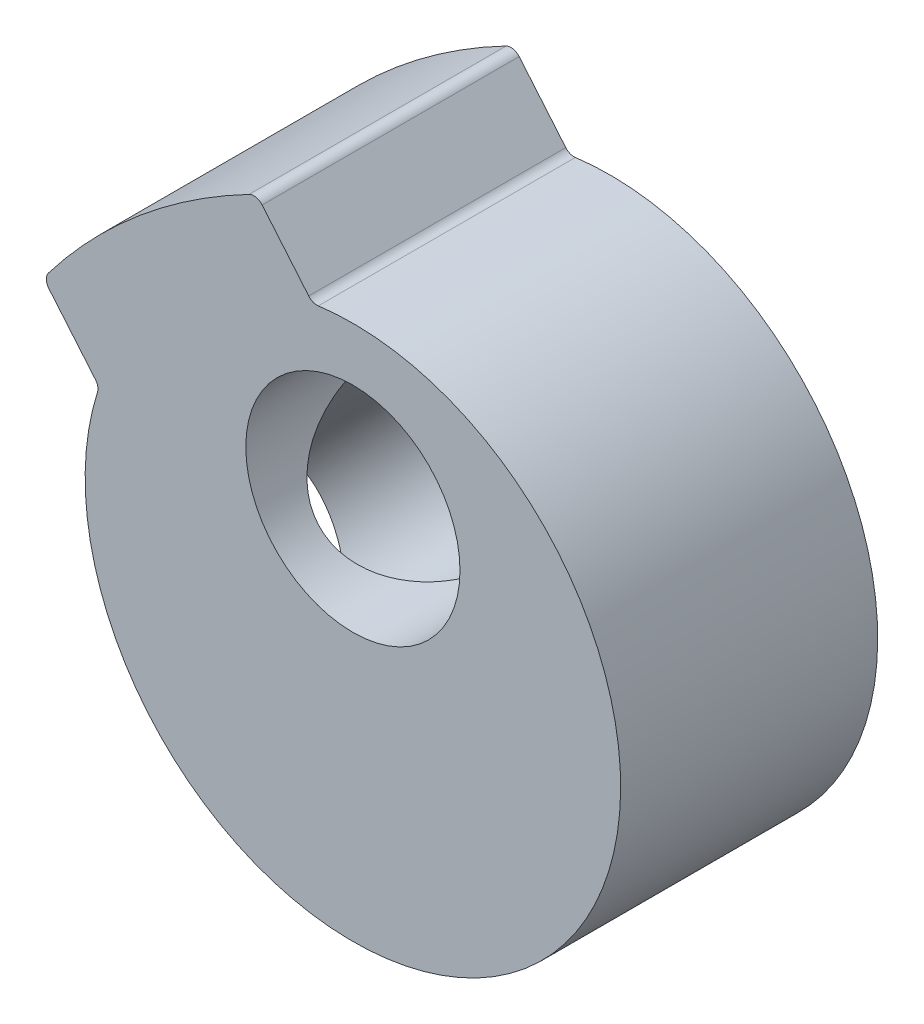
ISO-10303-21;
HEADER;
FILE_DESCRIPTION(('STEP AP214'),'2;1');
FILE_NAME('part.step','',(''),(''),'','','');
FILE_SCHEMA(('AUTOMOTIVE_DESIGN { 1 0 10303 214 1 1 1 1 }'));
ENDSEC;
DATA;
#1=APPLICATION_CONTEXT('core data for automotive mechanical design processes');
#2=APPLICATION_PROTOCOL_DEFINITION('international standard','automotive_design',2000,#1);
#3=PRODUCT_CONTEXT('',#1,'mechanical');
#4=PRODUCT('Part','Part','',(#3));
#5=PRODUCT_RELATED_PRODUCT_CATEGORY('part','',(#4));
#6=PRODUCT_DEFINITION_FORMATION('','',#4);
#7=PRODUCT_DEFINITION_CONTEXT('part definition',#1,'design');
#8=PRODUCT_DEFINITION('design','',#6,#7);
#9=PRODUCT_DEFINITION_SHAPE('','',#8);
#10=(LENGTH_UNIT() NAMED_UNIT(*) SI_UNIT(.MILLI.,.METRE.));
#11=(NAMED_UNIT(*) PLANE_ANGLE_UNIT() SI_UNIT($,.RADIAN.));
#12=(NAMED_UNIT(*) SI_UNIT($,.STERADIAN.) SOLID_ANGLE_UNIT());
#13=UNCERTAINTY_MEASURE_WITH_UNIT(LENGTH_MEASURE(1.E-05),#10,'distance_accuracy_value','');
#14=(GEOMETRIC_REPRESENTATION_CONTEXT(3) GLOBAL_UNCERTAINTY_ASSIGNED_CONTEXT((#13)) GLOBAL_UNIT_ASSIGNED_CONTEXT((#10,
#11,#12)) REPRESENTATION_CONTEXT('',''));
#15=CARTESIAN_POINT('',(0.,0.,0.));
#16=DIRECTION('',(0.,0.,1.));
#17=DIRECTION('',(1.,0.,0.));
#18=AXIS2_PLACEMENT_3D('',#15,#16,#17);
#19=CARTESIAN_POINT('',(-12.4036965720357,-1.10791683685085,6.));
#20=DIRECTION('',(0.,0.,1.));
#21=DIRECTION('',(1.,0.,0.));
#22=AXIS2_PLACEMENT_3D('',#19,#20,#21);
#23=PLANE('',#22);
#24=CARTESIAN_POINT('',(-12.4036965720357,-1.10791683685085,6.));
#25=DIRECTION('',(0.,0.,-1.));
#26=DIRECTION('',(1.,0.,0.));
#27=AXIS2_PLACEMENT_3D('',#24,#25,#26);
#28=CIRCLE('',#27,0.5);
#29=CARTESIAN_POINT('',(-12.0206743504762,-0.786523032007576,6.));
#30=VERTEX_POINT('',#29);
#31=CARTESIAN_POINT('',(-11.9266313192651,-1.25761234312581,6.));
#32=VERTEX_POINT('',#31);
#33=EDGE_CURVE('E148',#30,#32,#28,.T.);
#34=ORIENTED_EDGE('',*,*,#33,.T.);
#35=CARTESIAN_POINT('',(0.,-5.,6.));
#36=DIRECTION('',(0.,0.,1.));
#37=DIRECTION('',(1.,0.,0.));
#38=AXIS2_PLACEMENT_3D('',#35,#36,#37);
#39=CIRCLE('',#38,12.5);
#40=CARTESIAN_POINT('',(-1.61449458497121,7.39529778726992,6.));
#41=VERTEX_POINT('',#40);
#42=EDGE_CURVE('E125',#32,#41,#39,.T.);
#43=ORIENTED_EDGE('',*,*,#42,.T.);
#44=CARTESIAN_POINT('',(-1.67907436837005,7.89110969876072,6.));
#45=DIRECTION('',(0.,0.,-1.));
#46=DIRECTION('',(1.,0.,0.));
#47=AXIS2_PLACEMENT_3D('',#44,#45,#46);
#48=CIRCLE('',#47,0.499999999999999);
#49=CARTESIAN_POINT('',(-2.06209658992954,7.56971589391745,6.));
#50=VERTEX_POINT('',#49);
#51=EDGE_CURVE('E151',#41,#50,#48,.T.);
#52=ORIENTED_EDGE('',*,*,#51,.T.);
#53=DIRECTION('',(-0.642787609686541,0.766044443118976,0.));
#54=VECTOR('',#53,1.);
#55=CARTESIAN_POINT('',(-4.23666163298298,10.1612615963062,6.));
#56=LINE('',#55,#54);
#57=CARTESIAN_POINT('',(-4.23666163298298,10.1612615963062,6.));
#58=VERTEX_POINT('',#57);
#59=EDGE_CURVE('E153',#50,#58,#56,.T.);
#60=ORIENTED_EDGE('',*,*,#59,.T.);
#61=CARTESIAN_POINT('',(-4.61968385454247,9.83986779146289,6.));
#62=DIRECTION('',(0.,0.,1.));
#63=DIRECTION('',(-1.,0.,0.));
#64=AXIS2_PLACEMENT_3D('',#61,#62,#63);
#65=CIRCLE('',#64,0.499999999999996);
#66=CARTESIAN_POINT('',(-4.84976619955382,10.2837845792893,6.));
#67=VERTEX_POINT('',#66);
#68=EDGE_CURVE('E155',#58,#67,#65,.T.);
#69=ORIENTED_EDGE('',*,*,#68,.T.);
#70=CARTESIAN_POINT('',(8.03484512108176,-14.5755555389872,6.));
#71=DIRECTION('',(0.,0.,1.));
#72=DIRECTION('',(1.,0.,0.));
#73=AXIS2_PLACEMENT_3D('',#70,#71,#72);
#74=CIRCLE('',#73,28.);
#75=CARTESIAN_POINT('',(-14.2094364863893,2.43008869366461,6.));
#76=VERTEX_POINT('',#75);
#77=EDGE_CURVE('E157',#67,#76,#74,.T.);
#78=ORIENTED_EDGE('',*,*,#77,.T.);
#79=CARTESIAN_POINT('',(-13.8122171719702,2.1264164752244,6.));
#80=DIRECTION('',(0.,0.,1.));
#81=DIRECTION('',(1.,0.,0.));
#82=AXIS2_PLACEMENT_3D('',#79,#80,#81);
#83=CIRCLE('',#82,0.499999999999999);
#84=CARTESIAN_POINT('',(-14.1952393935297,1.80502267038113,6.));
#85=VERTEX_POINT('',#84);
#86=EDGE_CURVE('E66',#76,#85,#83,.T.);
#87=ORIENTED_EDGE('',*,*,#86,.T.);
#88=DIRECTION('',(0.642787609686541,-0.766044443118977,0.));
#89=VECTOR('',#88,1.);
#90=CARTESIAN_POINT('',(-14.1952393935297,1.80502267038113,6.));
#91=LINE('',#90,#89);
#92=EDGE_CURVE('E61',#85,#30,#91,.T.);
#93=ORIENTED_EDGE('',*,*,#92,.T.);
#94=EDGE_LOOP('',(#34,#43,#52,#60,#69,#78,#87,#93));
#95=FACE_BOUND('',#94,.T.);
#96=CARTESIAN_POINT('',(0.,0.,6.));
#97=DIRECTION('',(0.,0.,1.));
#98=DIRECTION('',(1.,0.,0.));
#99=AXIS2_PLACEMENT_3D('',#96,#97,#98);
#100=CIRCLE('',#99,5.);
#101=CARTESIAN_POINT('',(5.,0.,6.));
#102=VERTEX_POINT('',#101);
#103=EDGE_CURVE('E130',#102,#102,#100,.T.);
#104=ORIENTED_EDGE('',*,*,#103,.F.);
#105=EDGE_LOOP('',(#104));
#106=FACE_BOUND('',#105,.T.);
#107=ADVANCED_FACE('F40',(#95,#106),#23,.T.);
#108=CARTESIAN_POINT('',(-12.4036965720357,-1.10791683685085,-6.));
#109=DIRECTION('',(0.,0.,1.));
#110=DIRECTION('',(1.,0.,0.));
#111=AXIS2_PLACEMENT_3D('',#108,#109,#110);
#112=PLANE('',#111);
#113=CARTESIAN_POINT('',(-12.4036965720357,-1.10791683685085,-6.));
#114=DIRECTION('',(0.,0.,-1.));
#115=DIRECTION('',(1.,0.,0.));
#116=AXIS2_PLACEMENT_3D('',#113,#114,#115);
#117=CIRCLE('',#116,0.5);
#118=CARTESIAN_POINT('',(-12.0206743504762,-0.786523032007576,-6.));
#119=VERTEX_POINT('',#118);
#120=CARTESIAN_POINT('',(-11.9266313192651,-1.25761234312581,-6.));
#121=VERTEX_POINT('',#120);
#122=EDGE_CURVE('E116',#119,#121,#117,.T.);
#123=ORIENTED_EDGE('',*,*,#122,.F.);
#124=DIRECTION('',(0.642787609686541,-0.766044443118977,0.));
#125=VECTOR('',#124,1.);
#126=CARTESIAN_POINT('',(-14.1952393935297,1.80502267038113,-6.));
#127=LINE('',#126,#125);
#128=CARTESIAN_POINT('',(-14.1952393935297,1.80502267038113,-6.));
#129=VERTEX_POINT('',#128);
#130=EDGE_CURVE('E146',#129,#119,#127,.T.);
#131=ORIENTED_EDGE('',*,*,#130,.F.);
#132=CARTESIAN_POINT('',(-13.8122171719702,2.1264164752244,-6.));
#133=DIRECTION('',(0.,0.,1.));
#134=DIRECTION('',(1.,0.,0.));
#135=AXIS2_PLACEMENT_3D('',#132,#133,#134);
#136=CIRCLE('',#135,0.499999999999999);
#137=CARTESIAN_POINT('',(-14.2094364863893,2.43008869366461,-6.));
#138=VERTEX_POINT('',#137);
#139=EDGE_CURVE('E144',#138,#129,#136,.T.);
#140=ORIENTED_EDGE('',*,*,#139,.F.);
#141=CARTESIAN_POINT('',(8.03484512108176,-14.5755555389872,-6.));
#142=DIRECTION('',(0.,0.,1.));
#143=DIRECTION('',(1.,0.,0.));
#144=AXIS2_PLACEMENT_3D('',#141,#142,#143);
#145=CIRCLE('',#144,28.);
#146=CARTESIAN_POINT('',(-4.84976619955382,10.2837845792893,-6.));
#147=VERTEX_POINT('',#146);
#148=EDGE_CURVE('E142',#147,#138,#145,.T.);
#149=ORIENTED_EDGE('',*,*,#148,.F.);
#150=CARTESIAN_POINT('',(-4.61968385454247,9.83986779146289,-6.));
#151=DIRECTION('',(0.,0.,1.));
#152=DIRECTION('',(-1.,0.,0.));
#153=AXIS2_PLACEMENT_3D('',#150,#151,#152);
#154=CIRCLE('',#153,0.499999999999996);
#155=CARTESIAN_POINT('',(-4.23666163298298,10.1612615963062,-6.));
#156=VERTEX_POINT('',#155);
#157=EDGE_CURVE('E140',#156,#147,#154,.T.);
#158=ORIENTED_EDGE('',*,*,#157,.F.);
#159=DIRECTION('',(-0.642787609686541,0.766044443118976,0.));
#160=VECTOR('',#159,1.);
#161=CARTESIAN_POINT('',(-4.23666163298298,10.1612615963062,-6.));
#162=LINE('',#161,#160);
#163=CARTESIAN_POINT('',(-2.06209658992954,7.56971589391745,-6.));
#164=VERTEX_POINT('',#163);
#165=EDGE_CURVE('E138',#164,#156,#162,.T.);
#166=ORIENTED_EDGE('',*,*,#165,.F.);
#167=CARTESIAN_POINT('',(-1.67907436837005,7.89110969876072,-6.));
#168=DIRECTION('',(0.,0.,-1.));
#169=DIRECTION('',(1.,0.,0.));
#170=AXIS2_PLACEMENT_3D('',#167,#168,#169);
#171=CIRCLE('',#170,0.499999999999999);
#172=CARTESIAN_POINT('',(-1.61449458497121,7.39529778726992,-6.));
#173=VERTEX_POINT('',#172);
#174=EDGE_CURVE('E118',#173,#164,#171,.T.);
#175=ORIENTED_EDGE('',*,*,#174,.F.);
#176=CARTESIAN_POINT('',(0.,-5.,-6.));
#177=DIRECTION('',(0.,0.,1.));
#178=DIRECTION('',(1.,0.,0.));
#179=AXIS2_PLACEMENT_3D('',#176,#177,#178);
#180=CIRCLE('',#179,12.5);
#181=EDGE_CURVE('E111',#121,#173,#180,.T.);
#182=ORIENTED_EDGE('',*,*,#181,.F.);
#183=EDGE_LOOP('',(#123,#131,#140,#149,#158,#166,#175,#182));
#184=FACE_BOUND('',#183,.T.);
#185=CARTESIAN_POINT('',(0.,0.,-6.));
#186=DIRECTION('',(0.,0.,1.));
#187=DIRECTION('',(1.,0.,0.));
#188=AXIS2_PLACEMENT_3D('',#185,#186,#187);
#189=CIRCLE('',#188,5.);
#190=CARTESIAN_POINT('',(5.,0.,-6.));
#191=VERTEX_POINT('',#190);
#192=EDGE_CURVE('E133',#191,#191,#189,.T.);
#193=ORIENTED_EDGE('',*,*,#192,.T.);
#194=EDGE_LOOP('',(#193));
#195=FACE_BOUND('',#194,.T.);
#196=ADVANCED_FACE('F112',(#184,#195),#112,.F.);
#197=CARTESIAN_POINT('',(-12.4036965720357,-1.10791683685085,6.));
#198=DIRECTION('',(0.,0.,-1.));
#199=DIRECTION('',(-1.,0.,0.));
#200=AXIS2_PLACEMENT_3D('',#197,#198,#199);
#201=CYLINDRICAL_SURFACE('',#200,0.5);
#202=ORIENTED_EDGE('',*,*,#122,.T.);
#203=DIRECTION('',(0.,0.,-1.));
#204=VECTOR('',#203,1.);
#205=CARTESIAN_POINT('',(-11.9266313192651,-1.25761234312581,6.));
#206=LINE('',#205,#204);
#207=EDGE_CURVE('E11',#32,#121,#206,.T.);
#208=ORIENTED_EDGE('',*,*,#207,.F.);
#209=ORIENTED_EDGE('',*,*,#33,.F.);
#210=DIRECTION('',(0.,0.,-1.));
#211=VECTOR('',#210,1.);
#212=CARTESIAN_POINT('',(-12.0206743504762,-0.786523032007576,6.));
#213=LINE('',#212,#211);
#214=EDGE_CURVE('E129',#30,#119,#213,.T.);
#215=ORIENTED_EDGE('',*,*,#214,.T.);
#216=EDGE_LOOP('',(#202,#208,#209,#215));
#217=FACE_BOUND('',#216,.T.);
#218=ADVANCED_FACE('F42',(#217),#201,.F.);
#219=CARTESIAN_POINT('',(0.,-5.,6.));
#220=DIRECTION('',(0.,0.,-1.));
#221=DIRECTION('',(-1.,0.,0.));
#222=AXIS2_PLACEMENT_3D('',#219,#220,#221);
#223=CYLINDRICAL_SURFACE('',#222,12.5);
#224=CARTESIAN_POINT('',(-12.380580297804,-6.72372604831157,0.));
#225=CARTESIAN_POINT('',(-12.3805802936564,-6.72372607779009,0.0985646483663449));
#226=CARTESIAN_POINT('',(-12.3799518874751,-6.7282578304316,0.197129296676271));
#227=CARTESIAN_POINT('',(-12.3774226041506,-6.74627930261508,0.393455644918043));
#228=CARTESIAN_POINT('',(-12.3755212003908,-6.75977272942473,0.49121699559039));
#229=CARTESIAN_POINT('',(-12.3703998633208,-6.79541934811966,0.685130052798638));
#230=CARTESIAN_POINT('',(-12.3671796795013,-6.81757418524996,0.781281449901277));
#231=CARTESIAN_POINT('',(-12.3593505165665,-6.87006794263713,0.97128099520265));
#232=CARTESIAN_POINT('',(-12.354740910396,-6.90041055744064,1.06512808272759));
#233=CARTESIAN_POINT('',(-12.3387604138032,-7.0024320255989,1.34107903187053));
#234=CARTESIAN_POINT('',(-12.3252035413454,-7.0853757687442,1.51899942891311));
#235=CARTESIAN_POINT('',(-12.2913876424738,-7.27621092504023,1.85997105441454));
#236=CARTESIAN_POINT('',(-12.2711264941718,-7.38411023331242,2.02301755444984));
#237=CARTESIAN_POINT('',(-12.2204366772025,-7.63221127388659,2.34851029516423));
#238=CARTESIAN_POINT('',(-12.1891745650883,-7.77459736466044,2.5091584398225));
#239=CARTESIAN_POINT('',(-12.1160422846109,-8.07830225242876,2.80865753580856));
#240=CARTESIAN_POINT('',(-12.0741660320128,-8.23963187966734,2.94749591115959));
#241=CARTESIAN_POINT('',(-11.9703271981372,-8.60604340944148,3.22419113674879));
#242=CARTESIAN_POINT('',(-11.906132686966,-8.81384291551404,3.35763083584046));
#243=CARTESIAN_POINT('',(-11.7601561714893,-9.2426309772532,3.58966993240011));
#244=CARTESIAN_POINT('',(-11.6783658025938,-9.46362576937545,3.68825270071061));
#245=CARTESIAN_POINT('',(-11.5405948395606,-9.80422694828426,3.80889072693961));
#246=CARTESIAN_POINT('',(-11.4910463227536,-9.92163243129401,3.84497386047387));
#247=CARTESIAN_POINT('',(-11.3872663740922,-10.1571972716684,3.90624846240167));
#248=CARTESIAN_POINT('',(-11.3330369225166,-10.2753562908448,3.93144450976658));
#249=CARTESIAN_POINT('',(-11.2201456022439,-10.511392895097,3.97044492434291));
#250=CARTESIAN_POINT('',(-11.1614851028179,-10.629270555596,3.98425279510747));
#251=CARTESIAN_POINT('',(-11.0401135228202,-10.8637281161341,4.00004072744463));
#252=CARTESIAN_POINT('',(-10.9774028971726,-10.9803081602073,4.00202211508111));
#253=CARTESIAN_POINT('',(-10.8538115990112,-11.201571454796,3.99414112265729));
#254=CARTESIAN_POINT('',(-10.7932061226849,-11.3064432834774,3.98524147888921));
#255=CARTESIAN_POINT('',(-10.6696237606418,-11.5133435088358,3.95700845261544));
#256=CARTESIAN_POINT('',(-10.6066471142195,-11.6153721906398,3.93767612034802));
#257=CARTESIAN_POINT('',(-10.4790200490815,-11.8157349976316,3.88852701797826));
#258=CARTESIAN_POINT('',(-10.4143703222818,-11.9140706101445,3.85871451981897));
#259=CARTESIAN_POINT('',(-10.284147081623,-12.1063208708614,3.78867564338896));
#260=CARTESIAN_POINT('',(-10.2185736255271,-12.2002357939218,3.74844991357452));
#261=CARTESIAN_POINT('',(-10.0928943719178,-12.3752352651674,3.66162705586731));
#262=CARTESIAN_POINT('',(-10.0327940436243,-12.456733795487,3.61585383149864));
#263=CARTESIAN_POINT('',(-9.9132006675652,-12.6150044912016,3.51600261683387));
#264=CARTESIAN_POINT('',(-9.85370782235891,-12.6917751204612,3.46192194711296));
#265=CARTESIAN_POINT('',(-9.73608646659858,-12.8401262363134,3.34584433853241));
#266=CARTESIAN_POINT('',(-9.67795734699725,-12.9117090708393,3.28385101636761));
#267=CARTESIAN_POINT('',(-9.56372224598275,-13.0494239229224,3.15233364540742));
#268=CARTESIAN_POINT('',(-9.50761702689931,-13.1155538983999,3.08280679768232));
#269=CARTESIAN_POINT('',(-9.39915367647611,-13.2409134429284,2.93807473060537));
#270=CARTESIAN_POINT('',(-9.34674554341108,-13.3002477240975,2.86299777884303));
#271=CARTESIAN_POINT('',(-9.24518975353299,-13.4132181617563,2.7065956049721));
#272=CARTESIAN_POINT('',(-9.19604327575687,-13.4668522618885,2.62526814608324));
#273=CARTESIAN_POINT('',(-9.05444643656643,-13.6189436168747,2.37277487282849));
#274=CARTESIAN_POINT('',(-8.96773293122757,-13.7087100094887,2.19295820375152));
#275=CARTESIAN_POINT('',(-8.81264185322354,-13.8656542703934,1.81190191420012));
#276=CARTESIAN_POINT('',(-8.74464331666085,-13.9323713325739,1.61032061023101));
#277=CARTESIAN_POINT('',(-8.63263585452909,-14.0406687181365,1.19412687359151));
#278=CARTESIAN_POINT('',(-8.58862819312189,-14.0822477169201,0.979513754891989));
#279=CARTESIAN_POINT('',(-8.52658194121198,-14.1405287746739,0.540680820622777));
#280=CARTESIAN_POINT('',(-8.50885043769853,-14.1569367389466,0.31637845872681));
#281=CARTESIAN_POINT('',(-8.50129703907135,-14.163949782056,-0.133099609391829));
#282=CARTESIAN_POINT('',(-8.51147546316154,-14.1545545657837,-0.35827532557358));
#283=CARTESIAN_POINT('',(-8.55918413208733,-14.1099624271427,-0.803093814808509));
#284=CARTESIAN_POINT('',(-8.59671301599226,-14.074766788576,-1.02273686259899));
#285=CARTESIAN_POINT('',(-8.69709381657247,-13.978605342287,-1.45029312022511));
#286=CARTESIAN_POINT('',(-8.75994687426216,-13.917638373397,-1.65820580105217));
#287=CARTESIAN_POINT('',(-8.90768905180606,-13.7700590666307,-2.05651944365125));
#288=CARTESIAN_POINT('',(-8.99259140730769,-13.6834313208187,-2.2469097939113));
#289=CARTESIAN_POINT('',(-9.17998877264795,-13.4850668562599,-2.60455696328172));
#290=CARTESIAN_POINT('',(-9.28248259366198,-13.3733318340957,-2.77181534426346));
#291=CARTESIAN_POINT('',(-9.49885778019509,-13.127009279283,-3.07698946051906));
#292=CARTESIAN_POINT('',(-9.61263320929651,-12.9926273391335,-3.21514602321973));
#293=CARTESIAN_POINT('',(-9.84662614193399,-12.7025064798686,-3.45995208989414));
#294=CARTESIAN_POINT('',(-9.96684228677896,-12.54677205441,-3.56660820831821));
#295=CARTESIAN_POINT('',(-10.2055536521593,-12.220572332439,-3.74388040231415));
#296=CARTESIAN_POINT('',(-10.3240347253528,-12.0504671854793,-3.81517951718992));
#297=CARTESIAN_POINT('',(-10.5567267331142,-11.6970344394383,-3.92374162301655));
#298=CARTESIAN_POINT('',(-10.670937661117,-11.5137068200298,-3.96100456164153));
#299=CARTESIAN_POINT('',(-10.8917896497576,-11.1373323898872,-4.00189634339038));
#300=CARTESIAN_POINT('',(-10.998375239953,-10.9442289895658,-4.00529957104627));
#301=CARTESIAN_POINT('',(-11.2002993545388,-10.5544164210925,-3.97937196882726));
#302=CARTESIAN_POINT('',(-11.2956348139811,-10.3577062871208,-3.95003224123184));
#303=CARTESIAN_POINT('',(-11.4792703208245,-9.95267157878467,-3.85786342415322));
#304=CARTESIAN_POINT('',(-11.5667059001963,-9.74442631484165,-3.79297481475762));
#305=CARTESIAN_POINT('',(-11.7264479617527,-9.33461456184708,-3.63135181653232));
#306=CARTESIAN_POINT('',(-11.7987479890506,-9.1330509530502,-3.53460388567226));
#307=CARTESIAN_POINT('',(-11.9348499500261,-8.72294727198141,-3.30113541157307));
#308=CARTESIAN_POINT('',(-11.9971779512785,-8.51558345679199,-3.16147699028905));
#309=CARTESIAN_POINT('',(-12.1056236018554,-8.12180740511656,-2.8496644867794));
#310=CARTESIAN_POINT('',(-12.1517239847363,-7.9354176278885,-2.67747608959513));
#311=CARTESIAN_POINT('',(-12.2307513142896,-7.58680315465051,-2.29725839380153));
#312=CARTESIAN_POINT('',(-12.2632553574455,-7.42544064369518,-2.08833109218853));
#313=CARTESIAN_POINT('',(-12.3023244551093,-7.2153853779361,-1.7542509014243));
#314=CARTESIAN_POINT('',(-12.3137301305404,-7.15071958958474,-1.63949712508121));
#315=CARTESIAN_POINT('',(-12.333633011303,-7.03347569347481,-1.40370171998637));
#316=CARTESIAN_POINT('',(-12.3421314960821,-6.98089227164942,-1.28266288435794));
#317=CARTESIAN_POINT('',(-12.3546693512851,-6.90088089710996,-1.06651475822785));
#318=CARTESIAN_POINT('',(-12.3592926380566,-6.87045234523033,-0.972539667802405));
#319=CARTESIAN_POINT('',(-12.3671451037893,-6.81780965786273,-0.782264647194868));
#320=CARTESIAN_POINT('',(-12.3703746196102,-6.79559353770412,-0.685965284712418));
#321=CARTESIAN_POINT('',(-12.3755086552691,-6.7598615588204,-0.49181168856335));
#322=CARTESIAN_POINT('',(-12.3774143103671,-6.74633824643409,-0.393958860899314));
#323=CARTESIAN_POINT('',(-12.3799501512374,-6.72827035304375,-0.197404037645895));
#324=CARTESIAN_POINT('',(-12.3805803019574,-6.72372601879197,-0.0987020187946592));
#325=CARTESIAN_POINT('',(-12.380580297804,-6.72372604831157,0.));
#326=B_SPLINE_CURVE_WITH_KNOTS('',3,(#224,#225,#226,#227,#228,#229,#230,#231,#232,#233,#234,
#235,#236,#237,#238,#239,#240,#241,#242,#243,#244,#245,#246,#247,#248,#249,#250,#251,#252,#253,
#254,#255,#256,#257,#258,#259,#260,#261,#262,#263,#264,#265,#266,#267,#268,#269,#270,#271,#272,
#273,#274,#275,#276,#277,#278,#279,#280,#281,#282,#283,#284,#285,#286,#287,#288,#289,#290,#291,
#292,#293,#294,#295,#296,#297,#298,#299,#300,#301,#302,#303,#304,#305,#306,#307,#308,#309,#310,
#311,#312,#313,#314,#315,#316,#317,#318,#319,#320,#321,#322,#323,#324,#325),.UNSPECIFIED.,.T.,
.F.,(4,2,2,2,2,2,2,2,2,2,2,2,2,2,2,2,2,2,2,2,2,2,2,2,2,2,2,2,2,2,2,2,2,2,2,2,2,2,2,2,2,2,2,2,2,
2,2,2,2,2,4),(0.,0.295588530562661,0.591299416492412,0.887066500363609,1.18296726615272,
1.77052492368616,2.35826872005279,3.00666192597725,3.65542764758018,4.41764173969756,
5.18021897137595,5.57710271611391,5.97381937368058,6.37041393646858,6.7669640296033,
7.13082934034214,7.49465802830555,7.85833858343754,8.22199649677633,8.55497231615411,
8.88805575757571,9.22098749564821,9.55404335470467,9.88096101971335,10.2079962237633,
10.861436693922,11.5272728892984,12.1931441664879,12.8667376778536,13.5403388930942,
14.2139065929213,14.8875046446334,15.5615079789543,16.2354657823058,16.9036058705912,
17.571605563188,18.2261421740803,18.8806797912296,19.5395758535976,20.1986510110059,
20.9007142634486,21.6030763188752,22.3726074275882,23.1429548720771,23.9357446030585,
24.3317945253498,24.727669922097,25.023988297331,25.3202350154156,25.6162273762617,
25.9122278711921),.UNSPECIFIED.);
#327=CARTESIAN_POINT('',(-12.380580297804,-6.72372604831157,0.));
#328=VERTEX_POINT('',#327);
#329=EDGE_CURVE('E223',#328,#328,#326,.T.);
#330=ORIENTED_EDGE('',*,*,#329,.T.);
#331=EDGE_LOOP('',(#330));
#332=FACE_BOUND('',#331,.T.);
#333=ORIENTED_EDGE('',*,*,#181,.T.);
#334=DIRECTION('',(0.,0.,-1.));
#335=VECTOR('',#334,1.);
#336=CARTESIAN_POINT('',(-1.61449458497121,7.39529778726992,6.));
#337=LINE('',#336,#335);
#338=EDGE_CURVE('E54',#41,#173,#337,.T.);
#339=ORIENTED_EDGE('',*,*,#338,.F.);
#340=ORIENTED_EDGE('',*,*,#42,.F.);
#341=ORIENTED_EDGE('',*,*,#207,.T.);
#342=EDGE_LOOP('',(#333,#339,#340,#341));
#343=FACE_BOUND('',#342,.T.);
#344=ADVANCED_FACE('F124',(#332,#343),#223,.T.);
#345=CARTESIAN_POINT('',(-1.67907436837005,7.89110969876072,6.));
#346=DIRECTION('',(0.,0.,-1.));
#347=DIRECTION('',(-1.,0.,0.));
#348=AXIS2_PLACEMENT_3D('',#345,#346,#347);
#349=CYLINDRICAL_SURFACE('',#348,0.499999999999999);
#350=ORIENTED_EDGE('',*,*,#174,.T.);
#351=DIRECTION('',(0.,0.,-1.));
#352=VECTOR('',#351,1.);
#353=CARTESIAN_POINT('',(-2.06209658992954,7.56971589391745,6.));
#354=LINE('',#353,#352);
#355=EDGE_CURVE('E174',#50,#164,#354,.T.);
#356=ORIENTED_EDGE('',*,*,#355,.F.);
#357=ORIENTED_EDGE('',*,*,#51,.F.);
#358=ORIENTED_EDGE('',*,*,#338,.T.);
#359=EDGE_LOOP('',(#350,#356,#357,#358));
#360=FACE_BOUND('',#359,.T.);
#361=ADVANCED_FACE('F179',(#360),#349,.F.);
#362=CARTESIAN_POINT('',(-4.23666163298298,10.1612615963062,6.));
#363=DIRECTION('',(-0.766044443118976,-0.642787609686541,0.));
#364=DIRECTION('',(0.642787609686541,-0.766044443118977,0.));
#365=AXIS2_PLACEMENT_3D('',#362,#363,#364);
#366=PLANE('',#365);
#367=ORIENTED_EDGE('',*,*,#165,.T.);
#368=DIRECTION('',(0.,0.,-1.));
#369=VECTOR('',#368,1.);
#370=CARTESIAN_POINT('',(-4.23666163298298,10.1612615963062,6.));
#371=LINE('',#370,#369);
#372=EDGE_CURVE('E171',#58,#156,#371,.T.);
#373=ORIENTED_EDGE('',*,*,#372,.F.);
#374=ORIENTED_EDGE('',*,*,#59,.F.);
#375=ORIENTED_EDGE('',*,*,#355,.T.);
#376=EDGE_LOOP('',(#367,#373,#374,#375));
#377=FACE_BOUND('',#376,.T.);
#378=ADVANCED_FACE('F187',(#377),#366,.F.);
#379=CARTESIAN_POINT('',(-4.61968385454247,9.83986779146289,6.));
#380=DIRECTION('',(0.,0.,-1.));
#381=DIRECTION('',(-1.,0.,0.));
#382=AXIS2_PLACEMENT_3D('',#379,#380,#381);
#383=CYLINDRICAL_SURFACE('',#382,0.499999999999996);
#384=ORIENTED_EDGE('',*,*,#157,.T.);
#385=DIRECTION('',(0.,0.,-1.));
#386=VECTOR('',#385,1.);
#387=CARTESIAN_POINT('',(-4.84976619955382,10.2837845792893,6.));
#388=LINE('',#387,#386);
#389=EDGE_CURVE('E168',#67,#147,#388,.T.);
#390=ORIENTED_EDGE('',*,*,#389,.F.);
#391=ORIENTED_EDGE('',*,*,#68,.F.);
#392=ORIENTED_EDGE('',*,*,#372,.T.);
#393=EDGE_LOOP('',(#384,#390,#391,#392));
#394=FACE_BOUND('',#393,.T.);
#395=ADVANCED_FACE('F190',(#394),#383,.T.);
#396=CARTESIAN_POINT('',(8.03484512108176,-14.5755555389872,6.));
#397=DIRECTION('',(0.,0.,-1.));
#398=DIRECTION('',(-1.,0.,0.));
#399=AXIS2_PLACEMENT_3D('',#396,#397,#398);
#400=CYLINDRICAL_SURFACE('',#399,28.);
#401=ORIENTED_EDGE('',*,*,#148,.T.);
#402=DIRECTION('',(0.,0.,-1.));
#403=VECTOR('',#402,1.);
#404=CARTESIAN_POINT('',(-14.2094364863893,2.43008869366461,6.));
#405=LINE('',#404,#403);
#406=EDGE_CURVE('E165',#76,#138,#405,.T.);
#407=ORIENTED_EDGE('',*,*,#406,.F.);
#408=ORIENTED_EDGE('',*,*,#77,.F.);
#409=ORIENTED_EDGE('',*,*,#389,.T.);
#410=EDGE_LOOP('',(#401,#407,#408,#409));
#411=FACE_BOUND('',#410,.T.);
#412=ADVANCED_FACE('F195',(#411),#400,.T.);
#413=CARTESIAN_POINT('',(-13.8122171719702,2.1264164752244,6.));
#414=DIRECTION('',(0.,0.,-1.));
#415=DIRECTION('',(-1.,0.,0.));
#416=AXIS2_PLACEMENT_3D('',#413,#414,#415);
#417=CYLINDRICAL_SURFACE('',#416,0.499999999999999);
#418=ORIENTED_EDGE('',*,*,#139,.T.);
#419=DIRECTION('',(0.,0.,-1.));
#420=VECTOR('',#419,1.);
#421=CARTESIAN_POINT('',(-14.1952393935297,1.80502267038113,6.));
#422=LINE('',#421,#420);
#423=EDGE_CURVE('E162',#85,#129,#422,.T.);
#424=ORIENTED_EDGE('',*,*,#423,.F.);
#425=ORIENTED_EDGE('',*,*,#86,.F.);
#426=ORIENTED_EDGE('',*,*,#406,.T.);
#427=EDGE_LOOP('',(#418,#424,#425,#426));
#428=FACE_BOUND('',#427,.T.);
#429=ADVANCED_FACE('F198',(#428),#417,.T.);
#430=CARTESIAN_POINT('',(-14.1952393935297,1.80502267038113,6.));
#431=DIRECTION('',(0.766044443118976,0.642787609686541,0.));
#432=DIRECTION('',(-0.642787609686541,0.766044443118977,0.));
#433=AXIS2_PLACEMENT_3D('',#430,#431,#432);
#434=PLANE('',#433);
#435=ORIENTED_EDGE('',*,*,#130,.T.);
#436=ORIENTED_EDGE('',*,*,#214,.F.);
#437=ORIENTED_EDGE('',*,*,#92,.F.);
#438=ORIENTED_EDGE('',*,*,#423,.T.);
#439=EDGE_LOOP('',(#435,#436,#437,#438));
#440=FACE_BOUND('',#439,.T.);
#441=ADVANCED_FACE('F200',(#440),#434,.F.);
#442=CARTESIAN_POINT('',(0.,0.,6.));
#443=DIRECTION('',(0.,0.,-1.));
#444=DIRECTION('',(-1.,0.,0.));
#445=AXIS2_PLACEMENT_3D('',#442,#443,#444);
#446=CYLINDRICAL_SURFACE('',#445,5.);
#447=CARTESIAN_POINT('',(-5.,0.,1.87082869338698));
#448=CARTESIAN_POINT('',(-4.99999920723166,-0.0812449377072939,1.97939952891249));
#449=CARTESIAN_POINT('',(-4.99801059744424,-0.167032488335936,2.08461508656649));
#450=CARTESIAN_POINT('',(-4.98882133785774,-0.345985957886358,2.28841921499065));
#451=CARTESIAN_POINT('',(-4.98161657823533,-0.439157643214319,2.38700249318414));
#452=CARTESIAN_POINT('',(-4.96086844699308,-0.631819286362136,2.57769005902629));
#453=CARTESIAN_POINT('',(-4.94730650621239,-0.731327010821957,2.6697744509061));
#454=CARTESIAN_POINT('',(-4.91284702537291,-0.935218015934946,2.84678152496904));
#455=CARTESIAN_POINT('',(-4.89195237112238,-1.03959936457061,2.93170700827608));
#456=CARTESIAN_POINT('',(-4.82497264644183,-1.32403397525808,3.14870992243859));
#457=CARTESIAN_POINT('',(-4.77140108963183,-1.50767404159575,3.27399009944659));
#458=CARTESIAN_POINT('',(-4.63722518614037,-1.88020908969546,3.49914261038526));
#459=CARTESIAN_POINT('',(-4.55668603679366,-2.06909039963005,3.59907521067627));
#460=CARTESIAN_POINT('',(-4.3826818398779,-2.41298959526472,3.75400059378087));
#461=CARTESIAN_POINT('',(-4.29388670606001,-2.56819481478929,3.81378295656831));
#462=CARTESIAN_POINT('',(-4.09614603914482,-2.87306888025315,3.90971240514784));
#463=CARTESIAN_POINT('',(-3.98720922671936,-3.02274008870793,3.94586968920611));
#464=CARTESIAN_POINT('',(-3.75051997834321,-3.31189068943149,3.99237052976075));
#465=CARTESIAN_POINT('',(-3.62269557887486,-3.45132790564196,4.002612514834));
#466=CARTESIAN_POINT('',(-3.35236736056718,-3.71445865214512,3.99625067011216));
#467=CARTESIAN_POINT('',(-3.20986423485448,-3.83815292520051,3.97964810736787));
#468=CARTESIAN_POINT('',(-2.92472054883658,-4.05912523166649,3.92266745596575));
#469=CARTESIAN_POINT('',(-2.7826675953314,-4.15758442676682,3.88387211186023));
#470=CARTESIAN_POINT('',(-2.49447311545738,-4.3366363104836,3.78588655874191));
#471=CARTESIAN_POINT('',(-2.34833057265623,-4.41722451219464,3.72669123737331));
#472=CARTESIAN_POINT('',(-2.04321492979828,-4.56690186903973,3.58455449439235));
#473=CARTESIAN_POINT('',(-1.88421993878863,-4.63440470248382,3.50000798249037));
#474=CARTESIAN_POINT('',(-1.5699355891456,-4.7500936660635,3.31288545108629));
#475=CARTESIAN_POINT('',(-1.41464805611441,-4.7982704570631,3.21030074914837));
#476=CARTESIAN_POINT('',(-1.08041070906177,-4.88551383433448,2.96726873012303));
#477=CARTESIAN_POINT('',(-0.903000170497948,-4.92078701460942,2.82335746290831));
#478=CARTESIAN_POINT('',(-0.563040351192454,-4.97116552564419,2.51536930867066));
#479=CARTESIAN_POINT('',(-0.400512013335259,-4.98624283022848,2.35126474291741));
#480=CARTESIAN_POINT('',(-0.176407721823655,-4.99741493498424,2.094907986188));
#481=CARTESIAN_POINT('',(-0.106529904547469,-4.99931535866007,2.01002217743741));
#482=CARTESIAN_POINT('',(0.0275096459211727,-5.00037242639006,1.83577785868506));
#483=CARTESIAN_POINT('',(0.0916705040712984,-4.9995286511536,1.74641866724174));
#484=CARTESIAN_POINT('',(0.213023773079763,-4.99582834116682,1.56333539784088));
#485=CARTESIAN_POINT('',(0.27022871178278,-4.99297548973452,1.46961960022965));
#486=CARTESIAN_POINT('',(0.376366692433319,-4.98609833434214,1.27766573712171));
#487=CARTESIAN_POINT('',(0.425301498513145,-4.98207428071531,1.17942864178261));
#488=CARTESIAN_POINT('',(0.528649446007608,-4.9723328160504,0.943116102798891));
#489=CARTESIAN_POINT('',(0.578938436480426,-4.96651751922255,0.803178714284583));
#490=CARTESIAN_POINT('',(0.656208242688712,-4.95690993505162,0.517090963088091));
#491=CARTESIAN_POINT('',(0.683243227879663,-4.95311295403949,0.370955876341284));
#492=CARTESIAN_POINT('',(0.710467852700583,-4.94928927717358,0.0750400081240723));
#493=CARTESIAN_POINT('',(0.710475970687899,-4.94928807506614,-0.0747586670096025));
#494=CARTESIAN_POINT('',(0.683178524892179,-4.95312208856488,-0.371852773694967));
#495=CARTESIAN_POINT('',(0.655838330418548,-4.95696216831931,-0.519144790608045));
#496=CARTESIAN_POINT('',(0.568982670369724,-4.96774786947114,-0.839183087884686));
#497=CARTESIAN_POINT('',(0.503657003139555,-4.97519469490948,-1.01029160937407));
#498=CARTESIAN_POINT('',(0.346891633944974,-4.98856798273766,-1.34031178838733));
#499=CARTESIAN_POINT('',(0.25537429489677,-4.99448982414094,-1.49918537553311));
#500=CARTESIAN_POINT('',(0.0801801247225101,-4.99991298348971,-1.7639380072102));
#501=CARTESIAN_POINT('',(0.000829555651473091,-5.00069803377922,-1.87272118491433));
#502=CARTESIAN_POINT('',(-0.166191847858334,-4.99793463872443,-2.08371620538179));
#503=CARTESIAN_POINT('',(-0.253866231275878,-4.9943843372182,-2.18592521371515));
#504=CARTESIAN_POINT('',(-0.436069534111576,-4.98178670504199,-2.38385784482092));
#505=CARTESIAN_POINT('',(-0.530605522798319,-4.97273363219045,-2.47957457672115));
#506=CARTESIAN_POINT('',(-0.725235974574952,-4.9480960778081,-2.66425567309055));
#507=CARTESIAN_POINT('',(-0.825329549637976,-4.93251263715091,-2.75322111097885));
#508=CARTESIAN_POINT('',(-1.03186221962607,-4.89351617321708,-2.92558357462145));
#509=CARTESIAN_POINT('',(-1.13838253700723,-4.86996875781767,-3.00885333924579));
#510=CARTESIAN_POINT('',(-1.35504982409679,-4.81418298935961,-3.16745440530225));
#511=CARTESIAN_POINT('',(-1.46519735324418,-4.78194329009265,-3.24278447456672));
#512=CARTESIAN_POINT('',(-1.68766977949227,-4.70802135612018,-3.38447723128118));
#513=CARTESIAN_POINT('',(-1.79998820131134,-4.66636413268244,-3.45086294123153));
#514=CARTESIAN_POINT('',(-2.02568420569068,-4.57291238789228,-3.57383956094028));
#515=CARTESIAN_POINT('',(-2.13906118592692,-4.52112333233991,-3.63043572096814));
#516=CARTESIAN_POINT('',(-2.40747045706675,-4.38568407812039,-3.75172634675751));
#517=CARTESIAN_POINT('',(-2.56237050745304,-4.29733876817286,-3.8116504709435));
#518=CARTESIAN_POINT('',(-2.86662578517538,-4.10063713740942,-3.90797258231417));
#519=CARTESIAN_POINT('',(-3.01598518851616,-3.99229627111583,-3.94438864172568));
#520=CARTESIAN_POINT('',(-3.30469126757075,-3.75683589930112,-3.99159002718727));
#521=CARTESIAN_POINT('',(-3.44399475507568,-3.62964181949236,-4.00227052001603));
#522=CARTESIAN_POINT('',(-3.70702491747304,-3.36055972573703,-3.99692123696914));
#523=CARTESIAN_POINT('',(-3.83075146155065,-3.21867158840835,-3.98089123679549));
#524=CARTESIAN_POINT('',(-4.05219961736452,-2.93431184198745,-3.92503887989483));
#525=CARTESIAN_POINT('',(-4.15105148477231,-2.79241096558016,-3.88673779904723));
#526=CARTESIAN_POINT('',(-4.33090070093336,-2.5044264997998,-3.78968859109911));
#527=CARTESIAN_POINT('',(-4.41189351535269,-2.35834185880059,-3.73093528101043));
#528=CARTESIAN_POINT('',(-4.5622761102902,-2.05351385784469,-3.58977857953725));
#529=CARTESIAN_POINT('',(-4.63011104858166,-1.89474205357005,-3.50579840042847));
#530=CARTESIAN_POINT('',(-4.7464830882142,-1.58081292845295,-3.31980549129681));
#531=CARTESIAN_POINT('',(-4.79501112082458,-1.42565733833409,-3.21778431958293));
#532=CARTESIAN_POINT('',(-4.88299291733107,-1.09172752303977,-2.97608404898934));
#533=CARTESIAN_POINT('',(-4.91866928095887,-0.914464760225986,-2.8329566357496));
#534=CARTESIAN_POINT('',(-4.96984168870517,-0.574612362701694,-2.52659145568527));
#535=CARTESIAN_POINT('',(-4.98530932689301,-0.412043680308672,-2.36332573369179));
#536=CARTESIAN_POINT('',(-4.99703854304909,-0.18704614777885,-2.10755789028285));
#537=CARTESIAN_POINT('',(-4.99910308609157,-0.116464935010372,-2.02235081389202));
#538=CARTESIAN_POINT('',(-5.00042149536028,0.018955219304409,-1.84741026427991));
#539=CARTESIAN_POINT('',(-4.99967491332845,0.083793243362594,-1.75767607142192));
#540=CARTESIAN_POINT('',(-4.99611168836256,0.20646564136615,-1.57378519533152));
#541=CARTESIAN_POINT('',(-4.99329874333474,0.264312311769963,-1.47963669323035));
#542=CARTESIAN_POINT('',(-4.98645638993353,0.371680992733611,-1.28675853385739));
#543=CARTESIAN_POINT('',(-4.98242724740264,0.421204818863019,-1.18802988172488));
#544=CARTESIAN_POINT('',(-4.97266642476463,0.525552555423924,-0.951157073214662));
#545=CARTESIAN_POINT('',(-4.96682691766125,0.576310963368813,-0.811165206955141));
#546=CARTESIAN_POINT('',(-4.95713493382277,0.654534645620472,-0.524924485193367));
#547=CARTESIAN_POINT('',(-4.95327750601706,0.682058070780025,-0.378692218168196));
#548=CARTESIAN_POINT('',(-4.94932454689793,0.710232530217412,-0.0825021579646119));
#549=CARTESIAN_POINT('',(-4.94925412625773,0.71070419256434,0.0674739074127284));
#550=CARTESIAN_POINT('',(-4.95297689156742,0.684222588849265,0.365091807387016));
#551=CARTESIAN_POINT('',(-4.95677735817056,0.657217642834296,0.51272871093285));
#552=CARTESIAN_POINT('',(-4.96750075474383,0.571096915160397,0.832962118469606));
#553=CARTESIAN_POINT('',(-4.97492485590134,0.506249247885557,1.00395413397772));
#554=CARTESIAN_POINT('',(-4.98830031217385,0.350572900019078,1.33341364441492));
#555=CARTESIAN_POINT('',(-4.99425100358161,0.259732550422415,1.49187547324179));
#556=CARTESIAN_POINT('',(-4.99826700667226,0.134110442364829,1.6825988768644));
#557=CARTESIAN_POINT('',(-4.99890311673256,0.108066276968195,1.72081486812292));
#558=CARTESIAN_POINT('',(-4.99976959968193,0.0548567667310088,1.79642635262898));
#559=CARTESIAN_POINT('',(-5.00000027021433,0.0276922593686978,1.83382242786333));
#560=CARTESIAN_POINT('',(-5.,0.,1.87082869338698));
#561=B_SPLINE_CURVE_WITH_KNOTS('',3,(#447,#448,#449,#450,#451,#452,#453,#454,#455,#456,#457,
#458,#459,#460,#461,#462,#463,#464,#465,#466,#467,#468,#469,#470,#471,#472,#473,#474,#475,#476,
#477,#478,#479,#480,#481,#482,#483,#484,#485,#486,#487,#488,#489,#490,#491,#492,#493,#494,#495,
#496,#497,#498,#499,#500,#501,#502,#503,#504,#505,#506,#507,#508,#509,#510,#511,#512,#513,#514,
#515,#516,#517,#518,#519,#520,#521,#522,#523,#524,#525,#526,#527,#528,#529,#530,#531,#532,#533,
#534,#535,#536,#537,#538,#539,#540,#541,#542,#543,#544,#545,#546,#547,#548,#549,#550,#551,#552,
#553,#554,#555,#556,#557,#558,#559,#560),.UNSPECIFIED.,.T.,.F.,(4,2,2,2,2,2,2,2,2,2,2,2,2,2,2,2,
2,2,2,2,2,2,2,2,2,2,2,2,2,2,2,2,2,2,2,2,2,2,2,2,2,2,2,2,2,2,2,2,2,2,2,2,2,2,2,2,4),(0.,
0.406762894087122,0.813846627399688,1.22212692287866,1.63024671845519,2.31342748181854,
2.99496835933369,3.55821419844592,4.12121673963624,4.6864224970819,5.25160157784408,
5.78075963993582,6.31005040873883,6.88488884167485,7.46000472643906,8.15103899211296,
8.84303122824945,9.17271102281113,9.50244119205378,9.83156842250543,10.1606253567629,
10.6053888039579,11.0491133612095,11.4958181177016,11.9430892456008,12.489983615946,
13.0385161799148,13.4419956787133,13.8456479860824,14.2497222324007,14.6537320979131,
15.0649312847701,15.4761941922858,15.8863774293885,16.2963399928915,16.8582154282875,
17.4196583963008,17.9833845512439,18.5471154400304,19.0762334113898,19.6054855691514,
20.1793773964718,20.7535384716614,21.4429630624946,22.1333556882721,22.4651274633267,
22.7969521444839,23.1281844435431,23.4593443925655,23.9047483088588,24.349034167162,
24.7962656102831,25.2443397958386,25.790427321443,26.336760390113,26.475507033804,
26.6141517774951),.UNSPECIFIED.);
#562=CARTESIAN_POINT('',(-5.,0.,1.87082869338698));
#563=VERTEX_POINT('',#562);
#564=EDGE_CURVE('E44',#563,#563,#561,.T.);
#565=ORIENTED_EDGE('',*,*,#564,.F.);
#566=EDGE_LOOP('',(#565));
#567=FACE_BOUND('',#566,.T.);
#568=ORIENTED_EDGE('',*,*,#103,.T.);
#569=EDGE_LOOP('',(#568));
#570=FACE_BOUND('',#569,.T.);
#571=ORIENTED_EDGE('',*,*,#192,.F.);
#572=EDGE_LOOP('',(#571));
#573=FACE_BOUND('',#572,.T.);
#574=ADVANCED_FACE('F202',(#567,#570,#573),#446,.F.);
#575=CARTESIAN_POINT('',(-15.9061085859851,-15.9061085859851,0.));
#576=DIRECTION('',(0.707106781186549,0.707106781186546,0.));
#577=DIRECTION('',(-0.707106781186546,0.707106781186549,0.));
#578=AXIS2_PLACEMENT_3D('',#575,#576,#577);
#579=CYLINDRICAL_SURFACE('',#578,4.);
#580=ORIENTED_EDGE('',*,*,#564,.T.);
#581=EDGE_LOOP('',(#580));
#582=FACE_BOUND('',#581,.T.);
#583=ORIENTED_EDGE('',*,*,#329,.F.);
#584=EDGE_LOOP('',(#583));
#585=FACE_BOUND('',#584,.T.);
#586=ADVANCED_FACE('F208',(#582,#585),#579,.F.);
#587=CLOSED_SHELL('',(#107,#196,#218,#344,#361,#378,#395,#412,#429,#441,#574,#586));
#588=MANIFOLD_SOLID_BREP('B2',#587);
#589=ADVANCED_BREP_SHAPE_REPRESENTATION('',(#18,#588),#14);
#590=SHAPE_DEFINITION_REPRESENTATION(#9,#589);
ENDSEC;
END-ISO-10303-21;
